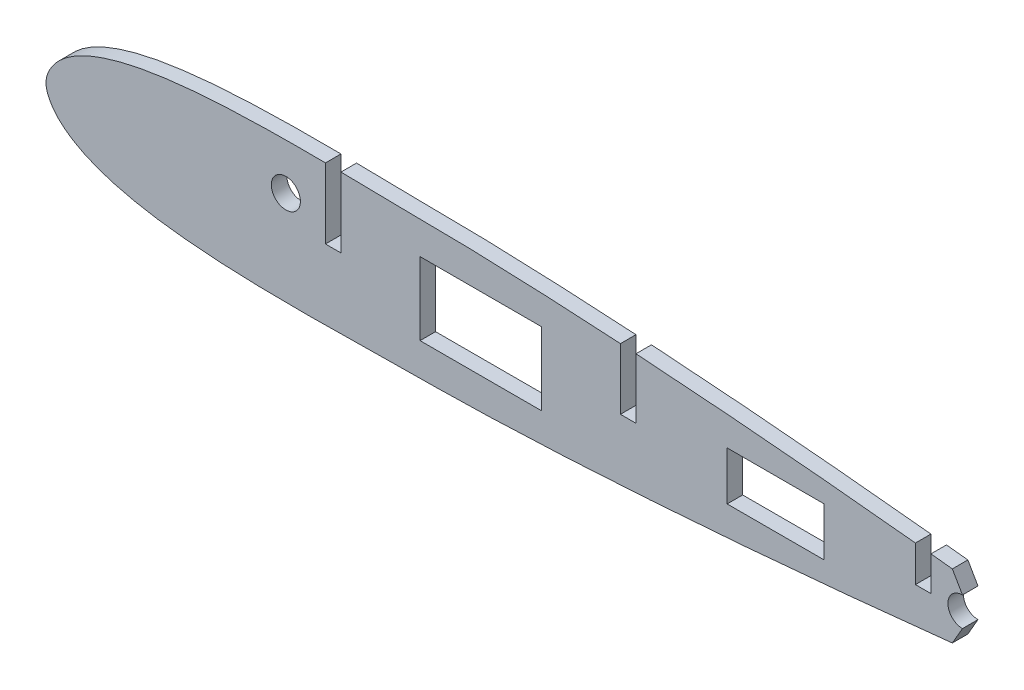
ISO-10303-21;
HEADER;
FILE_DESCRIPTION(('STEP AP214'),'2;1');
FILE_NAME('part.step','',(''),(''),'','','');
FILE_SCHEMA(('AUTOMOTIVE_DESIGN { 1 0 10303 214 1 1 1 1 }'));
ENDSEC;
DATA;
#1=APPLICATION_CONTEXT('core data for automotive mechanical design processes');
#2=APPLICATION_PROTOCOL_DEFINITION('international standard','automotive_design',2000,#1);
#3=PRODUCT_CONTEXT('',#1,'mechanical');
#4=PRODUCT('Part','Part','',(#3));
#5=PRODUCT_RELATED_PRODUCT_CATEGORY('part','',(#4));
#6=PRODUCT_DEFINITION_FORMATION('','',#4);
#7=PRODUCT_DEFINITION_CONTEXT('part definition',#1,'design');
#8=PRODUCT_DEFINITION('design','',#6,#7);
#9=PRODUCT_DEFINITION_SHAPE('','',#8);
#10=(LENGTH_UNIT() NAMED_UNIT(*) SI_UNIT(.MILLI.,.METRE.));
#11=(NAMED_UNIT(*) PLANE_ANGLE_UNIT() SI_UNIT($,.RADIAN.));
#12=(NAMED_UNIT(*) SI_UNIT($,.STERADIAN.) SOLID_ANGLE_UNIT());
#13=UNCERTAINTY_MEASURE_WITH_UNIT(LENGTH_MEASURE(1.E-05),#10,'distance_accuracy_value','');
#14=(GEOMETRIC_REPRESENTATION_CONTEXT(3) GLOBAL_UNCERTAINTY_ASSIGNED_CONTEXT((#13)) GLOBAL_UNIT_ASSIGNED_CONTEXT((#10,
#11,#12)) REPRESENTATION_CONTEXT('',''));
#15=CARTESIAN_POINT('',(0.,0.,0.));
#16=DIRECTION('',(0.,0.,1.));
#17=DIRECTION('',(1.,0.,0.));
#18=AXIS2_PLACEMENT_3D('',#15,#16,#17);
#19=CARTESIAN_POINT('',(73.1109777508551,2.76717396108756,3.2));
#20=DIRECTION('',(0.,0.,1.));
#21=DIRECTION('',(1.,0.,0.));
#22=AXIS2_PLACEMENT_3D('',#19,#20,#21);
#23=PLANE('',#22);
#24=CARTESIAN_POINT('',(-88.6046583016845,3.96718901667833,3.2));
#25=DIRECTION('',(0.,0.,1.));
#26=DIRECTION('',(1.,0.,0.));
#27=AXIS2_PLACEMENT_3D('',#24,#25,#26);
#28=CIRCLE('',#27,3.00000000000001);
#29=CARTESIAN_POINT('',(-85.6046583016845,3.96718901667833,3.2));
#30=VERTEX_POINT('',#29);
#31=EDGE_CURVE('E492',#30,#30,#28,.T.);
#32=ORIENTED_EDGE('',*,*,#31,.F.);
#33=EDGE_LOOP('',(#32));
#34=FACE_BOUND('',#33,.T.);
#35=DIRECTION('',(1.,0.,0.));
#36=VECTOR('',#35,1.);
#37=CARTESIAN_POINT('',(-60.9374477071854,-8.53281098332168,3.2));
#38=LINE('',#37,#36);
#39=CARTESIAN_POINT('',(-60.9374477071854,-8.53281098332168,3.2));
#40=VERTEX_POINT('',#39);
#41=CARTESIAN_POINT('',(-35.9374477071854,-8.53281098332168,3.2));
#42=VERTEX_POINT('',#41);
#43=EDGE_CURVE('E546',#40,#42,#38,.T.);
#44=ORIENTED_EDGE('',*,*,#43,.F.);
#45=DIRECTION('',(0.,-1.,0.));
#46=VECTOR('',#45,1.);
#47=CARTESIAN_POINT('',(-60.9374477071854,6.46718901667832,3.2));
#48=LINE('',#47,#46);
#49=CARTESIAN_POINT('',(-60.9374477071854,6.46718901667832,3.2));
#50=VERTEX_POINT('',#49);
#51=EDGE_CURVE('E543',#50,#40,#48,.T.);
#52=ORIENTED_EDGE('',*,*,#51,.F.);
#53=DIRECTION('',(-1.,0.,0.));
#54=VECTOR('',#53,1.);
#55=CARTESIAN_POINT('',(-60.9374477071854,6.46718901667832,3.2));
#56=LINE('',#55,#54);
#57=CARTESIAN_POINT('',(-35.9374477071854,6.46718901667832,3.2));
#58=VERTEX_POINT('',#57);
#59=EDGE_CURVE('E554',#58,#50,#56,.T.);
#60=ORIENTED_EDGE('',*,*,#59,.F.);
#61=DIRECTION('',(0.,1.,0.));
#62=VECTOR('',#61,1.);
#63=CARTESIAN_POINT('',(-35.9374477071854,6.46718901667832,3.2));
#64=LINE('',#63,#62);
#65=EDGE_CURVE('E550',#42,#58,#64,.T.);
#66=ORIENTED_EDGE('',*,*,#65,.F.);
#67=EDGE_LOOP('',(#44,#52,#60,#66));
#68=FACE_BOUND('',#67,.T.);
#69=DIRECTION('',(1.,0.,0.));
#70=VECTOR('',#69,1.);
#71=CARTESIAN_POINT('',(2.36255229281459,-6.03281098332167,3.2));
#72=LINE('',#71,#70);
#73=CARTESIAN_POINT('',(2.36255229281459,-6.03281098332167,3.2));
#74=VERTEX_POINT('',#73);
#75=CARTESIAN_POINT('',(22.3625522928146,-6.03281098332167,3.2));
#76=VERTEX_POINT('',#75);
#77=EDGE_CURVE('E503',#74,#76,#72,.T.);
#78=ORIENTED_EDGE('',*,*,#77,.F.);
#79=DIRECTION('',(0.,-1.,0.));
#80=VECTOR('',#79,1.);
#81=CARTESIAN_POINT('',(2.36255229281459,-6.03281098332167,3.2));
#82=LINE('',#81,#80);
#83=CARTESIAN_POINT('',(2.36255229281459,3.96718901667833,3.2));
#84=VERTEX_POINT('',#83);
#85=EDGE_CURVE('E500',#84,#74,#82,.T.);
#86=ORIENTED_EDGE('',*,*,#85,.F.);
#87=DIRECTION('',(-1.,0.,0.));
#88=VECTOR('',#87,1.);
#89=CARTESIAN_POINT('',(2.36255229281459,3.96718901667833,3.2));
#90=LINE('',#89,#88);
#91=CARTESIAN_POINT('',(22.3625522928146,3.96718901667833,3.2));
#92=VERTEX_POINT('',#91);
#93=EDGE_CURVE('E511',#92,#84,#90,.T.);
#94=ORIENTED_EDGE('',*,*,#93,.F.);
#95=DIRECTION('',(0.,1.,0.));
#96=VECTOR('',#95,1.);
#97=CARTESIAN_POINT('',(22.3625522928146,-6.03281098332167,3.2));
#98=LINE('',#97,#96);
#99=EDGE_CURVE('E507',#76,#92,#98,.T.);
#100=ORIENTED_EDGE('',*,*,#99,.F.);
#101=EDGE_LOOP('',(#78,#86,#94,#100));
#102=FACE_BOUND('',#101,.T.);
#103=CARTESIAN_POINT('',(50.8625522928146,-1.03281098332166,3.2));
#104=DIRECTION('',(0.,0.,1.));
#105=DIRECTION('',(1.,0.,0.));
#106=AXIS2_PLACEMENT_3D('',#103,#104,#105);
#107=CIRCLE('',#106,3.);
#108=CARTESIAN_POINT('',(50.8625522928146,-4.03281098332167,3.2));
#109=VERTEX_POINT('',#108);
#110=CARTESIAN_POINT('',(50.8625522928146,1.96718901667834,3.2));
#111=VERTEX_POINT('',#110);
#112=EDGE_CURVE('E483',#109,#111,#107,.F.);
#113=ORIENTED_EDGE('',*,*,#112,.T.);
#114=DIRECTION('',(-0.500000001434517,0.86602540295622,0.));
#115=VECTOR('',#114,1.);
#116=CARTESIAN_POINT('',(56.0782550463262,-7.06667311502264,3.2));
#117=LINE('',#116,#115);
#118=CARTESIAN_POINT('',(48.7762275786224,5.58080940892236,3.2));
#119=VERTEX_POINT('',#118);
#120=EDGE_CURVE('E476',#111,#119,#117,.T.);
#121=ORIENTED_EDGE('',*,*,#120,.T.);
#122=CARTESIAN_POINT('',(44.3625522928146,6.05528791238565,3.2));
#123=CARTESIAN_POINT('',(45.8339647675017,5.89887388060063,3.2));
#124=CARTESIAN_POINT('',(47.3051899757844,5.74069659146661,3.2));
#125=CARTESIAN_POINT('',(48.7762257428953,5.58077271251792,3.2));
#126=B_SPLINE_CURVE_WITH_KNOTS('',3,(#122,#123,#124,#125),.UNSPECIFIED.,.F.,.F.,(4,4),
(0.105515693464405,0.114627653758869),.UNSPECIFIED.);
#127=CARTESIAN_POINT('',(44.3625522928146,6.05528791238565,3.2));
#128=VERTEX_POINT('',#127);
#129=EDGE_CURVE('E278',#119,#128,#126,.F.);
#130=ORIENTED_EDGE('',*,*,#129,.T.);
#131=DIRECTION('',(0.,-1.,0.));
#132=VECTOR('',#131,1.);
#133=CARTESIAN_POINT('',(44.3625522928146,-1.03281098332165,3.2));
#134=LINE('',#133,#132);
#135=CARTESIAN_POINT('',(44.3625522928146,-1.03281098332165,3.2));
#136=VERTEX_POINT('',#135);
#137=EDGE_CURVE('E468',#128,#136,#134,.T.);
#138=ORIENTED_EDGE('',*,*,#137,.T.);
#139=DIRECTION('',(-1.,0.,0.));
#140=VECTOR('',#139,1.);
#141=CARTESIAN_POINT('',(41.1625522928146,-1.03281098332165,3.2));
#142=LINE('',#141,#140);
#143=CARTESIAN_POINT('',(41.1625522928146,-1.03281098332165,3.2));
#144=VERTEX_POINT('',#143);
#145=EDGE_CURVE('E418',#136,#144,#142,.T.);
#146=ORIENTED_EDGE('',*,*,#145,.T.);
#147=DIRECTION('',(0.,1.,0.));
#148=VECTOR('',#147,1.);
#149=CARTESIAN_POINT('',(41.1625522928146,-1.03281098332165,3.2));
#150=LINE('',#149,#148);
#151=CARTESIAN_POINT('',(41.1625522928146,6.39263718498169,3.2));
#152=VERTEX_POINT('',#151);
#153=EDGE_CURVE('E435',#144,#152,#150,.T.);
#154=ORIENTED_EDGE('',*,*,#153,.T.);
#155=CARTESIAN_POINT('',(41.1625522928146,6.39263718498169,3.2));
#156=CARTESIAN_POINT('',(40.8858120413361,6.42156748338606,3.2));
#157=CARTESIAN_POINT('',(36.6466893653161,6.86375130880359,3.2));
#158=CARTESIAN_POINT('',(28.444890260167,7.69043450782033,3.2));
#159=CARTESIAN_POINT('',(16.5536717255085,8.8075333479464,3.2));
#160=CARTESIAN_POINT('',(4.66201903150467,9.82931238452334,3.2));
#161=CARTESIAN_POINT('',(-6.33430215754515,10.6875926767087,3.2));
#162=CARTESIAN_POINT('',(-13.3686011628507,11.1761671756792,3.2));
#163=CARTESIAN_POINT('',(-16.4374477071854,11.3777301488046,3.2));
#164=B_SPLINE_CURVE_WITH_KNOTS('',3,(#155,#156,#157,#158,#159,#160,#161,#162,#163),
.UNSPECIFIED.,.F.,.F.,(4,1,1,1,1,1,4),(0.121232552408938,0.12294599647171,0.147478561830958,
0.171994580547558,0.196493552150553,0.220976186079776,0.239914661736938),.UNSPECIFIED.);
#165=CARTESIAN_POINT('',(-16.4374477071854,11.3777301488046,3.2));
#166=VERTEX_POINT('',#165);
#167=EDGE_CURVE('E431',#152,#166,#164,.T.);
#168=ORIENTED_EDGE('',*,*,#167,.T.);
#169=DIRECTION('',(0.,-1.,0.));
#170=VECTOR('',#169,1.);
#171=CARTESIAN_POINT('',(-16.4374477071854,-1.03281098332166,3.2));
#172=LINE('',#171,#170);
#173=CARTESIAN_POINT('',(-16.4374477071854,-1.03281098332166,3.2));
#174=VERTEX_POINT('',#173);
#175=EDGE_CURVE('E434',#166,#174,#172,.T.);
#176=ORIENTED_EDGE('',*,*,#175,.T.);
#177=DIRECTION('',(-1.,0.,0.));
#178=VECTOR('',#177,1.);
#179=CARTESIAN_POINT('',(-19.6374477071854,-1.03281098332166,3.2));
#180=LINE('',#179,#178);
#181=CARTESIAN_POINT('',(-19.6374477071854,-1.03281098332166,3.2));
#182=VERTEX_POINT('',#181);
#183=EDGE_CURVE('E440',#174,#182,#180,.T.);
#184=ORIENTED_EDGE('',*,*,#183,.T.);
#185=DIRECTION('',(0.,1.,0.));
#186=VECTOR('',#185,1.);
#187=CARTESIAN_POINT('',(-19.6374477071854,-1.03281098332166,3.2));
#188=LINE('',#187,#186);
#189=CARTESIAN_POINT('',(-19.6374477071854,11.5837049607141,3.2));
#190=VERTEX_POINT('',#189);
#191=EDGE_CURVE('E914',#182,#190,#188,.T.);
#192=ORIENTED_EDGE('',*,*,#191,.T.);
#193=CARTESIAN_POINT('',(-19.6374477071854,11.5837049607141,3.2));
#194=CARTESIAN_POINT('',(-23.5083202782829,11.827758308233,3.2));
#195=CARTESIAN_POINT('',(-31.3414661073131,12.2834181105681,3.2));
#196=CARTESIAN_POINT('',(-43.1420287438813,12.7942893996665,3.2));
#197=CARTESIAN_POINT('',(-55.0341757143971,13.1770742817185,3.2));
#198=CARTESIAN_POINT('',(-64.8677051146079,13.1698438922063,3.2));
#199=CARTESIAN_POINT('',(-72.2668637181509,13.3417556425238,3.2));
#200=CARTESIAN_POINT('',(-75.703508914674,13.3931359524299,3.2));
#201=CARTESIAN_POINT('',(-77.2374477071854,13.4117089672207,3.2));
#202=B_SPLINE_CURVE_WITH_KNOTS('',3,(#193,#194,#195,#196,#197,#198,#199,#200,#201),
.UNSPECIFIED.,.F.,.F.,(4,1,1,1,1,1,4),(0.246496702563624,0.270380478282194,0.29481296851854,
0.319231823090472,0.343641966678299,0.355360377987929,0.364806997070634),.UNSPECIFIED.);
#203=CARTESIAN_POINT('',(-77.2374477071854,13.4117089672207,3.2));
#204=VERTEX_POINT('',#203);
#205=EDGE_CURVE('E910',#190,#204,#202,.T.);
#206=ORIENTED_EDGE('',*,*,#205,.T.);
#207=DIRECTION('',(0.,-1.,0.));
#208=VECTOR('',#207,1.);
#209=CARTESIAN_POINT('',(-77.2374477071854,-1.03281098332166,3.2));
#210=LINE('',#209,#208);
#211=CARTESIAN_POINT('',(-77.2374477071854,-1.03281098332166,3.2));
#212=VERTEX_POINT('',#211);
#213=EDGE_CURVE('E913',#204,#212,#210,.T.);
#214=ORIENTED_EDGE('',*,*,#213,.T.);
#215=DIRECTION('',(-1.,0.,0.));
#216=VECTOR('',#215,1.);
#217=CARTESIAN_POINT('',(-80.4374477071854,-1.03281098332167,3.2));
#218=LINE('',#217,#216);
#219=CARTESIAN_POINT('',(-80.4374477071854,-1.03281098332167,3.2));
#220=VERTEX_POINT('',#219);
#221=EDGE_CURVE('E316',#212,#220,#218,.T.);
#222=ORIENTED_EDGE('',*,*,#221,.T.);
#223=DIRECTION('',(0.,1.,0.));
#224=VECTOR('',#223,1.);
#225=CARTESIAN_POINT('',(-80.4374477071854,-1.03281098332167,3.2));
#226=LINE('',#225,#224);
#227=CARTESIAN_POINT('',(-80.4374477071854,13.4443350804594,3.2));
#228=VERTEX_POINT('',#227);
#229=EDGE_CURVE('E236',#220,#228,#226,.T.);
#230=ORIENTED_EDGE('',*,*,#229,.T.);
#231=CARTESIAN_POINT('',(48.7726808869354,-7.65250874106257,3.2));
#232=CARTESIAN_POINT('',(45.9601822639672,-7.95856970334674,3.2));
#233=CARTESIAN_POINT('',(39.1855199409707,-8.68024311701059,3.2));
#234=CARTESIAN_POINT('',(28.4458294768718,-9.76389533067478,3.2));
#235=CARTESIAN_POINT('',(16.5547312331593,-10.8822738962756,3.2));
#236=CARTESIAN_POINT('',(4.66318857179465,-11.9053327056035,3.2));
#237=CARTESIAN_POINT('',(-7.22792859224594,-12.8347407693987,3.2));
#238=CARTESIAN_POINT('',(-19.1986067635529,-13.6543817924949,3.2));
#239=CARTESIAN_POINT('',(-31.1689328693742,-14.3558874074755,3.2));
#240=CARTESIAN_POINT('',(-43.1405398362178,-14.8754543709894,3.2));
#241=CARTESIAN_POINT('',(-55.0326455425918,-15.2595190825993,3.2));
#242=CARTESIAN_POINT('',(-64.8661756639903,-15.2533469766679,3.2));
#243=CARTESIAN_POINT('',(-72.7132535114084,-15.4365106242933,3.2));
#244=CARTESIAN_POINT('',(-78.5797220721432,-15.518516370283,3.2));
#245=CARTESIAN_POINT('',(-84.5255792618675,-15.5617901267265,3.2));
#246=CARTESIAN_POINT('',(-90.4719237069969,-15.5358258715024,3.2));
#247=CARTESIAN_POINT('',(-96.4190160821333,-15.4127594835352,3.2));
#248=CARTESIAN_POINT('',(-102.36777540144,-15.161949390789,3.2));
#249=CARTESIAN_POINT('',(-108.319189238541,-14.7332647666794,3.2));
#250=CARTESIAN_POINT('',(-113.876633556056,-14.1149004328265,3.2));
#251=CARTESIAN_POINT('',(-119.039849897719,-13.2685763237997,3.2));
#252=CARTESIAN_POINT('',(-123.006900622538,-12.366000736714,3.2));
#253=CARTESIAN_POINT('',(-126.168593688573,-11.4102824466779,3.2));
#254=CARTESIAN_POINT('',(-128.56161871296,-10.5358069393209,3.2));
#255=CARTESIAN_POINT('',(-130.968718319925,-9.43922639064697,3.2));
#256=CARTESIAN_POINT('',(-133.41846393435,-8.00234949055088,3.2));
#257=CARTESIAN_POINT('',(-135.450617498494,-6.3218790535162,3.2));
#258=CARTESIAN_POINT('',(-137.240403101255,-4.07244498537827,3.2));
#259=CARTESIAN_POINT('',(-138.557845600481,-1.04571684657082,3.2));
#260=CARTESIAN_POINT('',(-137.240728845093,1.98115305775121,3.2));
#261=CARTESIAN_POINT('',(-135.451185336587,4.23077972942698,3.2));
#262=CARTESIAN_POINT('',(-133.419212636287,5.91146885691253,3.2));
#263=CARTESIAN_POINT('',(-130.96962167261,7.3486093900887,3.2));
#264=CARTESIAN_POINT('',(-128.562640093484,8.44544898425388,3.2));
#265=CARTESIAN_POINT('',(-126.169709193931,9.32018202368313,3.2));
#266=CARTESIAN_POINT('',(-123.008119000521,10.276240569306,3.2));
#267=CARTESIAN_POINT('',(-119.041165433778,11.1792430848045,3.2));
#268=CARTESIAN_POINT('',(-113.878040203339,12.026122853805,3.2));
#269=CARTESIAN_POINT('',(-108.320662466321,12.6450852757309,3.2));
#270=CARTESIAN_POINT('',(-102.369294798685,13.0744103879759,3.2));
#271=CARTESIAN_POINT('',(-96.4205625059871,13.3258606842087,3.2));
#272=CARTESIAN_POINT('',(-90.4734834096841,13.4495670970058,3.2));
#273=CARTESIAN_POINT('',(-85.1458243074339,13.4734032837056,3.2));
#274=CARTESIAN_POINT('',(-81.8006706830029,13.4554971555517,3.2));
#275=CARTESIAN_POINT('',(-80.4374477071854,13.4443350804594,3.2));
#276=B_SPLINE_CURVE_WITH_KNOTS('',3,(#231,#232,#233,#234,#235,#236,#237,#238,#239,#240,#241,
#242,#243,#244,#245,#246,#247,#248,#249,#250,#251,#252,#253,#254,#255,#256,#257,#258,#259,#260,
#261,#262,#263,#264,#265,#266,#267,#268,#269,#270,#271,#272,#273,#274,#275),.UNSPECIFIED.,.F.,
.F.,(4,1,1,1,1,1,1,1,1,1,1,1,1,1,1,1,1,1,1,1,1,1,1,1,1,1,1,1,1,1,1,1,1,1,1,1,1,1,1,1,1,1,4),
(0.371375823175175,0.388797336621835,0.413329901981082,0.437845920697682,0.462344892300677,
0.486827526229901,0.511293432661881,0.536231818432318,0.560664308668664,0.585083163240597,
0.609493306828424,0.621211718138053,0.633417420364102,0.645622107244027,0.657826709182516,
0.670033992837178,0.682250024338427,0.694487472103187,0.706771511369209,0.716669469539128,
0.726694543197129,0.731796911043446,0.737000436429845,0.742373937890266,0.748059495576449,
0.754469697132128,0.758419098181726,0.765851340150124,0.773283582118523,0.777232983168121,
0.7836431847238,0.789328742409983,0.794702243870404,0.799905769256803,0.80500813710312,
0.815033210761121,0.82493116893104,0.837215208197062,0.849452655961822,0.861668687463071,
0.873875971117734,0.886080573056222,0.89447551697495),.UNSPECIFIED.);
#277=CARTESIAN_POINT('',(48.7727036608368,-7.65253499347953,3.2017127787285));
#278=VERTEX_POINT('',#277);
#279=EDGE_CURVE('E226',#228,#278,#276,.F.);
#280=ORIENTED_EDGE('',*,*,#279,.T.);
#281=DIRECTION('',(-0.499999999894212,-0.866025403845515,0.));
#282=VECTOR('',#281,1.);
#283=CARTESIAN_POINT('',(59.3691385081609,10.7010285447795,3.2));
#284=LINE('',#283,#282);
#285=EDGE_CURVE('E210',#109,#278,#284,.T.);
#286=ORIENTED_EDGE('',*,*,#285,.F.);
#287=EDGE_LOOP('',(#113,#121,#130,#138,#146,#154,#168,#176,#184,#192,#206,#214,#222,#230,#280,#286));
#288=FACE_BOUND('',#287,.T.);
#289=ADVANCED_FACE('F49',(#34,#68,#102,#288),#23,.T.);
#290=CARTESIAN_POINT('',(73.1109777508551,2.76717396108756,0.));
#291=DIRECTION('',(0.,0.,1.));
#292=DIRECTION('',(1.,0.,0.));
#293=AXIS2_PLACEMENT_3D('',#290,#291,#292);
#294=PLANE('',#293);
#295=CARTESIAN_POINT('',(-88.6046583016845,3.96718901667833,0.));
#296=DIRECTION('',(0.,0.,1.));
#297=DIRECTION('',(1.,0.,0.));
#298=AXIS2_PLACEMENT_3D('',#295,#296,#297);
#299=CIRCLE('',#298,3.00000000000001);
#300=CARTESIAN_POINT('',(-85.6046583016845,3.96718901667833,0.));
#301=VERTEX_POINT('',#300);
#302=EDGE_CURVE('E488',#301,#301,#299,.T.);
#303=ORIENTED_EDGE('',*,*,#302,.T.);
#304=EDGE_LOOP('',(#303));
#305=FACE_BOUND('',#304,.T.);
#306=DIRECTION('',(0.,-1.,0.));
#307=VECTOR('',#306,1.);
#308=CARTESIAN_POINT('',(2.36255229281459,-6.03281098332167,0.));
#309=LINE('',#308,#307);
#310=CARTESIAN_POINT('',(2.3625522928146,3.96718901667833,0.));
#311=VERTEX_POINT('',#310);
#312=CARTESIAN_POINT('',(2.36255229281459,-6.03281098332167,0.));
#313=VERTEX_POINT('',#312);
#314=EDGE_CURVE('E496',#311,#313,#309,.T.);
#315=ORIENTED_EDGE('',*,*,#314,.T.);
#316=DIRECTION('',(1.,0.,0.));
#317=VECTOR('',#316,1.);
#318=CARTESIAN_POINT('',(2.36255229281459,-6.03281098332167,0.));
#319=LINE('',#318,#317);
#320=CARTESIAN_POINT('',(22.3625522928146,-6.03281098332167,0.));
#321=VERTEX_POINT('',#320);
#322=EDGE_CURVE('E518',#313,#321,#319,.T.);
#323=ORIENTED_EDGE('',*,*,#322,.T.);
#324=DIRECTION('',(0.,1.,0.));
#325=VECTOR('',#324,1.);
#326=CARTESIAN_POINT('',(22.3625522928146,-6.03281098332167,0.));
#327=LINE('',#326,#325);
#328=CARTESIAN_POINT('',(22.3625522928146,3.96718901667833,0.));
#329=VERTEX_POINT('',#328);
#330=EDGE_CURVE('E522',#321,#329,#327,.T.);
#331=ORIENTED_EDGE('',*,*,#330,.T.);
#332=DIRECTION('',(-1.,0.,0.));
#333=VECTOR('',#332,1.);
#334=CARTESIAN_POINT('',(2.36255229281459,3.96718901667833,0.));
#335=LINE('',#334,#333);
#336=EDGE_CURVE('E504',#329,#311,#335,.T.);
#337=ORIENTED_EDGE('',*,*,#336,.T.);
#338=EDGE_LOOP('',(#315,#323,#331,#337));
#339=FACE_BOUND('',#338,.T.);
#340=DIRECTION('',(0.,-1.,0.));
#341=VECTOR('',#340,1.);
#342=CARTESIAN_POINT('',(-60.9374477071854,6.46718901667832,0.));
#343=LINE('',#342,#341);
#344=CARTESIAN_POINT('',(-60.9374477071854,6.46718901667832,0.));
#345=VERTEX_POINT('',#344);
#346=CARTESIAN_POINT('',(-60.9374477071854,-8.53281098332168,0.));
#347=VERTEX_POINT('',#346);
#348=EDGE_CURVE('E542',#345,#347,#343,.T.);
#349=ORIENTED_EDGE('',*,*,#348,.T.);
#350=DIRECTION('',(1.,0.,0.));
#351=VECTOR('',#350,1.);
#352=CARTESIAN_POINT('',(-60.9374477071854,-8.53281098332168,0.));
#353=LINE('',#352,#351);
#354=CARTESIAN_POINT('',(-35.9374477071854,-8.53281098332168,0.));
#355=VERTEX_POINT('',#354);
#356=EDGE_CURVE('E561',#347,#355,#353,.T.);
#357=ORIENTED_EDGE('',*,*,#356,.T.);
#358=DIRECTION('',(0.,1.,0.));
#359=VECTOR('',#358,1.);
#360=CARTESIAN_POINT('',(-35.9374477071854,6.46718901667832,0.));
#361=LINE('',#360,#359);
#362=CARTESIAN_POINT('',(-35.9374477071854,6.46718901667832,0.));
#363=VERTEX_POINT('',#362);
#364=EDGE_CURVE('E565',#355,#363,#361,.T.);
#365=ORIENTED_EDGE('',*,*,#364,.T.);
#366=DIRECTION('',(-1.,0.,0.));
#367=VECTOR('',#366,1.);
#368=CARTESIAN_POINT('',(-60.9374477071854,6.46718901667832,0.));
#369=LINE('',#368,#367);
#370=EDGE_CURVE('E547',#363,#345,#369,.T.);
#371=ORIENTED_EDGE('',*,*,#370,.T.);
#372=EDGE_LOOP('',(#349,#357,#365,#371));
#373=FACE_BOUND('',#372,.T.);
#374=DIRECTION('',(-0.500000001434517,0.86602540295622,0.));
#375=VECTOR('',#374,1.);
#376=CARTESIAN_POINT('',(56.0782550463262,-7.06667311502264,0.));
#377=LINE('',#376,#375);
#378=CARTESIAN_POINT('',(50.8625522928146,1.96718901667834,0.));
#379=VERTEX_POINT('',#378);
#380=CARTESIAN_POINT('',(48.7762503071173,5.5807700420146,0.));
#381=VERTEX_POINT('',#380);
#382=EDGE_CURVE('E471',#379,#381,#377,.T.);
#383=ORIENTED_EDGE('',*,*,#382,.F.);
#384=CARTESIAN_POINT('',(50.8625522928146,-1.03281098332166,0.));
#385=DIRECTION('',(0.,0.,-1.));
#386=DIRECTION('',(-1.,0.,0.));
#387=AXIS2_PLACEMENT_3D('',#384,#385,#386);
#388=CIRCLE('',#387,3.);
#389=CARTESIAN_POINT('',(50.8625522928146,-4.03281098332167,0.));
#390=VERTEX_POINT('',#389);
#391=EDGE_CURVE('E473',#390,#379,#388,.T.);
#392=ORIENTED_EDGE('',*,*,#391,.F.);
#393=DIRECTION('',(-0.499999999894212,-0.866025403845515,0.));
#394=VECTOR('',#393,1.);
#395=CARTESIAN_POINT('',(59.3691385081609,10.7010285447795,0.));
#396=LINE('',#395,#394);
#397=CARTESIAN_POINT('',(48.7727214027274,-7.65250477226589,-1.20769492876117E-05));
#398=VERTEX_POINT('',#397);
#399=EDGE_CURVE('E70',#390,#398,#396,.T.);
#400=ORIENTED_EDGE('',*,*,#399,.T.);
#401=CARTESIAN_POINT('',(-80.4374477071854,13.4443350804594,0.));
#402=CARTESIAN_POINT('',(-81.8006706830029,13.4554971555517,0.));
#403=CARTESIAN_POINT('',(-85.1458243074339,13.4734032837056,0.));
#404=CARTESIAN_POINT('',(-90.4734834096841,13.4495670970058,0.));
#405=CARTESIAN_POINT('',(-96.4205625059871,13.3258606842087,0.));
#406=CARTESIAN_POINT('',(-102.369294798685,13.0744103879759,0.));
#407=CARTESIAN_POINT('',(-108.320662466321,12.6450852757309,0.));
#408=CARTESIAN_POINT('',(-113.878040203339,12.026122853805,0.));
#409=CARTESIAN_POINT('',(-119.041165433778,11.1792430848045,0.));
#410=CARTESIAN_POINT('',(-123.008119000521,10.276240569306,0.));
#411=CARTESIAN_POINT('',(-126.169709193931,9.32018202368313,0.));
#412=CARTESIAN_POINT('',(-128.562640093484,8.44544898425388,0.));
#413=CARTESIAN_POINT('',(-130.96962167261,7.3486093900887,0.));
#414=CARTESIAN_POINT('',(-133.419212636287,5.91146885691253,0.));
#415=CARTESIAN_POINT('',(-135.451185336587,4.23077972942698,0.));
#416=CARTESIAN_POINT('',(-137.240728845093,1.98115305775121,0.));
#417=CARTESIAN_POINT('',(-138.557845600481,-1.04571684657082,0.));
#418=CARTESIAN_POINT('',(-137.240403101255,-4.07244498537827,0.));
#419=CARTESIAN_POINT('',(-135.450617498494,-6.3218790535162,0.));
#420=CARTESIAN_POINT('',(-133.41846393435,-8.00234949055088,0.));
#421=CARTESIAN_POINT('',(-130.968718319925,-9.43922639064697,0.));
#422=CARTESIAN_POINT('',(-128.56161871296,-10.5358069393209,0.));
#423=CARTESIAN_POINT('',(-126.168593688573,-11.4102824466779,0.));
#424=CARTESIAN_POINT('',(-123.006900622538,-12.366000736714,0.));
#425=CARTESIAN_POINT('',(-119.039849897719,-13.2685763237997,0.));
#426=CARTESIAN_POINT('',(-113.876633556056,-14.1149004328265,0.));
#427=CARTESIAN_POINT('',(-108.319189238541,-14.7332647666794,0.));
#428=CARTESIAN_POINT('',(-102.36777540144,-15.161949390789,0.));
#429=CARTESIAN_POINT('',(-96.4190160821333,-15.4127594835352,0.));
#430=CARTESIAN_POINT('',(-90.4719237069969,-15.5358258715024,0.));
#431=CARTESIAN_POINT('',(-84.5255792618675,-15.5617901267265,0.));
#432=CARTESIAN_POINT('',(-78.5797220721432,-15.518516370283,0.));
#433=CARTESIAN_POINT('',(-72.7132535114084,-15.4365106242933,0.));
#434=CARTESIAN_POINT('',(-64.8661756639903,-15.2533469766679,0.));
#435=CARTESIAN_POINT('',(-55.0326455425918,-15.2595190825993,0.));
#436=CARTESIAN_POINT('',(-43.1405398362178,-14.8754543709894,0.));
#437=CARTESIAN_POINT('',(-31.1689328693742,-14.3558874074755,0.));
#438=CARTESIAN_POINT('',(-19.1986067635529,-13.6543817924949,0.));
#439=CARTESIAN_POINT('',(-7.22792859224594,-12.8347407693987,0.));
#440=CARTESIAN_POINT('',(4.66318857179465,-11.9053327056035,0.));
#441=CARTESIAN_POINT('',(16.5547312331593,-10.8822738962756,0.));
#442=CARTESIAN_POINT('',(28.4458294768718,-9.76389533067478,0.));
#443=CARTESIAN_POINT('',(39.1855334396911,-8.68024175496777,0.));
#444=CARTESIAN_POINT('',(45.9602092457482,-7.95856682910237,0.));
#445=CARTESIAN_POINT('',(48.7727213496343,-7.65250433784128,0.));
#446=B_SPLINE_CURVE_WITH_KNOTS('',3,(#401,#402,#403,#404,#405,#406,#407,#408,#409,#410,#411,
#412,#413,#414,#415,#416,#417,#418,#419,#420,#421,#422,#423,#424,#425,#426,#427,#428,#429,#430,
#431,#432,#433,#434,#435,#436,#437,#438,#439,#440,#441,#442,#443,#444,#445),.UNSPECIFIED.,.F.,
.F.,(4,1,1,1,1,1,1,1,1,1,1,1,1,1,1,1,1,1,1,1,1,1,1,1,1,1,1,1,1,1,1,1,1,1,1,1,1,1,1,1,1,1,4),
(0.371375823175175,0.379770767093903,0.391975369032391,0.404182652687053,0.416398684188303,
0.428636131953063,0.440920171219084,0.450818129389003,0.460843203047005,0.465945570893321,
0.471149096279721,0.476522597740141,0.482208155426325,0.488618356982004,0.492567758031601,0.5,
0.507432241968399,0.511381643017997,0.517791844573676,0.523477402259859,0.528850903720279,
0.534054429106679,0.539156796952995,0.549181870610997,0.559079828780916,0.571363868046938,
0.583601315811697,0.595817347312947,0.608024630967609,0.620229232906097,0.632433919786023,
0.644639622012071,0.656358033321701,0.680768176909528,0.70518703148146,0.729619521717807,
0.754557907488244,0.779023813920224,0.803506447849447,0.828005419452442,0.852521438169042,
0.87705400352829,0.894475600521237),.UNSPECIFIED.);
#447=CARTESIAN_POINT('',(-80.4374477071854,13.4443350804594,0.));
#448=VERTEX_POINT('',#447);
#449=EDGE_CURVE('E229',#448,#398,#446,.T.);
#450=ORIENTED_EDGE('',*,*,#449,.F.);
#451=DIRECTION('',(-8.50716584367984E-13,1.,0.));
#452=VECTOR('',#451,1.);
#453=CARTESIAN_POINT('',(-80.4374477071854,13.4117089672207,0.));
#454=LINE('',#453,#452);
#455=CARTESIAN_POINT('',(-80.4374477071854,-1.03281098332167,0.));
#456=VERTEX_POINT('',#455);
#457=EDGE_CURVE('E282',#456,#448,#454,.T.);
#458=ORIENTED_EDGE('',*,*,#457,.F.);
#459=DIRECTION('',(-1.,0.,0.));
#460=VECTOR('',#459,1.);
#461=CARTESIAN_POINT('',(-80.4374477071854,-1.03281098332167,0.));
#462=LINE('',#461,#460);
#463=CARTESIAN_POINT('',(-77.2374477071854,-1.03281098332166,0.));
#464=VERTEX_POINT('',#463);
#465=EDGE_CURVE('E285',#464,#456,#462,.T.);
#466=ORIENTED_EDGE('',*,*,#465,.F.);
#467=DIRECTION('',(0.,-1.,0.));
#468=VECTOR('',#467,1.);
#469=CARTESIAN_POINT('',(-77.2374477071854,-1.03281098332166,0.));
#470=LINE('',#469,#468);
#471=CARTESIAN_POINT('',(-77.2374477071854,13.4117089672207,0.));
#472=VERTEX_POINT('',#471);
#473=EDGE_CURVE('E363',#472,#464,#470,.T.);
#474=ORIENTED_EDGE('',*,*,#473,.F.);
#475=CARTESIAN_POINT('',(-19.6374477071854,11.5837049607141,0.));
#476=CARTESIAN_POINT('',(-23.5083202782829,11.827758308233,0.));
#477=CARTESIAN_POINT('',(-31.3414661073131,12.2834181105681,0.));
#478=CARTESIAN_POINT('',(-43.1420287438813,12.7942893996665,0.));
#479=CARTESIAN_POINT('',(-55.0341757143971,13.1770742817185,0.));
#480=CARTESIAN_POINT('',(-64.8677051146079,13.1698438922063,0.));
#481=CARTESIAN_POINT('',(-72.2668637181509,13.3417556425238,0.));
#482=CARTESIAN_POINT('',(-75.703508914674,13.3931359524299,0.));
#483=CARTESIAN_POINT('',(-77.2374477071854,13.4117089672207,0.));
#484=B_SPLINE_CURVE_WITH_KNOTS('',3,(#475,#476,#477,#478,#479,#480,#481,#482,#483),
.UNSPECIFIED.,.F.,.F.,(4,1,1,1,1,1,4),(0.246496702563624,0.270380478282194,0.29481296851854,
0.319231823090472,0.343641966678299,0.355360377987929,0.364806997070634),.UNSPECIFIED.);
#485=CARTESIAN_POINT('',(-19.6374477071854,11.5837049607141,0.));
#486=VERTEX_POINT('',#485);
#487=EDGE_CURVE('E358',#486,#472,#484,.T.);
#488=ORIENTED_EDGE('',*,*,#487,.F.);
#489=DIRECTION('',(0.,1.,0.));
#490=VECTOR('',#489,1.);
#491=CARTESIAN_POINT('',(-19.6374477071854,11.3777301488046,0.));
#492=LINE('',#491,#490);
#493=CARTESIAN_POINT('',(-19.6374477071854,-1.03281098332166,0.));
#494=VERTEX_POINT('',#493);
#495=EDGE_CURVE('E355',#494,#486,#492,.T.);
#496=ORIENTED_EDGE('',*,*,#495,.F.);
#497=DIRECTION('',(-1.,0.,0.));
#498=VECTOR('',#497,1.);
#499=CARTESIAN_POINT('',(-19.6374477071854,-1.03281098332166,0.));
#500=LINE('',#499,#498);
#501=CARTESIAN_POINT('',(-16.4374477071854,-1.03281098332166,0.));
#502=VERTEX_POINT('',#501);
#503=EDGE_CURVE('E351',#502,#494,#500,.T.);
#504=ORIENTED_EDGE('',*,*,#503,.F.);
#505=DIRECTION('',(0.,-1.,0.));
#506=VECTOR('',#505,1.);
#507=CARTESIAN_POINT('',(-16.4374477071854,-1.03281098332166,0.));
#508=LINE('',#507,#506);
#509=CARTESIAN_POINT('',(-16.4374477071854,11.3777301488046,0.));
#510=VERTEX_POINT('',#509);
#511=EDGE_CURVE('E345',#510,#502,#508,.T.);
#512=ORIENTED_EDGE('',*,*,#511,.F.);
#513=CARTESIAN_POINT('',(41.1625522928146,6.39263718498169,0.));
#514=CARTESIAN_POINT('',(40.8858120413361,6.42156748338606,0.));
#515=CARTESIAN_POINT('',(36.6466893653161,6.86375130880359,0.));
#516=CARTESIAN_POINT('',(28.444890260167,7.69043450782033,0.));
#517=CARTESIAN_POINT('',(16.5536717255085,8.8075333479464,0.));
#518=CARTESIAN_POINT('',(4.66201903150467,9.82931238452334,0.));
#519=CARTESIAN_POINT('',(-6.33430215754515,10.6875926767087,0.));
#520=CARTESIAN_POINT('',(-13.3686011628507,11.1761671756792,0.));
#521=CARTESIAN_POINT('',(-16.4374477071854,11.3777301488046,0.));
#522=B_SPLINE_CURVE_WITH_KNOTS('',3,(#513,#514,#515,#516,#517,#518,#519,#520,#521),
.UNSPECIFIED.,.F.,.F.,(4,1,1,1,1,1,4),(0.121232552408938,0.12294599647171,0.147478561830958,
0.171994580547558,0.196493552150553,0.220976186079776,0.239914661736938),.UNSPECIFIED.);
#523=CARTESIAN_POINT('',(41.1625522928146,6.39263718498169,0.));
#524=VERTEX_POINT('',#523);
#525=EDGE_CURVE('E340',#524,#510,#522,.T.);
#526=ORIENTED_EDGE('',*,*,#525,.F.);
#527=DIRECTION('',(0.,1.,0.));
#528=VECTOR('',#527,1.);
#529=CARTESIAN_POINT('',(41.1625522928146,6.05528791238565,0.));
#530=LINE('',#529,#528);
#531=CARTESIAN_POINT('',(41.1625522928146,-1.03281098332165,0.));
#532=VERTEX_POINT('',#531);
#533=EDGE_CURVE('E337',#532,#524,#530,.T.);
#534=ORIENTED_EDGE('',*,*,#533,.F.);
#535=DIRECTION('',(-1.,0.,0.));
#536=VECTOR('',#535,1.);
#537=CARTESIAN_POINT('',(41.1625522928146,-1.03281098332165,0.));
#538=LINE('',#537,#536);
#539=CARTESIAN_POINT('',(44.3625522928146,-1.03281098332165,0.));
#540=VERTEX_POINT('',#539);
#541=EDGE_CURVE('E333',#540,#532,#538,.T.);
#542=ORIENTED_EDGE('',*,*,#541,.F.);
#543=DIRECTION('',(0.,-1.,0.));
#544=VECTOR('',#543,1.);
#545=CARTESIAN_POINT('',(44.3625522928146,-1.03281098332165,0.));
#546=LINE('',#545,#544);
#547=CARTESIAN_POINT('',(44.3625522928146,6.05528791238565,0.));
#548=VERTEX_POINT('',#547);
#549=EDGE_CURVE('E326',#548,#540,#546,.T.);
#550=ORIENTED_EDGE('',*,*,#549,.F.);
#551=CARTESIAN_POINT('',(101.799188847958,-1.01023941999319,0.));
#552=CARTESIAN_POINT('',(97.1662744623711,-0.37213420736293,0.));
#553=CARTESIAN_POINT('',(88.5756524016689,0.81992622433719,0.));
#554=CARTESIAN_POINT('',(76.0115979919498,2.42157660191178,0.));
#555=CARTESIAN_POINT('',(64.120042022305,3.86166442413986,0.));
#556=CARTESIAN_POINT('',(53.5701477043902,5.06228088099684,0.));
#557=CARTESIAN_POINT('',(46.9835418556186,5.77667158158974,0.));
#558=CARTESIAN_POINT('',(44.3625522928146,6.05528791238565,0.));
#559=B_SPLINE_CURVE_WITH_KNOTS('',3,(#551,#552,#553,#554,#555,#556,#557,#558),.UNSPECIFIED.,.F.,
.F.,(4,1,1,1,1,4),(-0.00416433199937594,0.0246342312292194,0.0492428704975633,
0.0738297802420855,0.0983967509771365,0.114627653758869),.UNSPECIFIED.);
#560=EDGE_CURVE('E318',#381,#548,#559,.T.);
#561=ORIENTED_EDGE('',*,*,#560,.F.);
#562=EDGE_LOOP('',(#383,#392,#400,#450,#458,#466,#474,#488,#496,#504,#512,#526,#534,#542,#550,#561));
#563=FACE_BOUND('',#562,.T.);
#564=ADVANCED_FACE('F256',(#305,#339,#373,#563),#294,.F.);
#565=CARTESIAN_POINT('',(101.799188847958,-1.01023941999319,3.2));
#566=CARTESIAN_POINT('',(97.1662744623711,-0.37213420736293,3.2));
#567=CARTESIAN_POINT('',(88.5756524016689,0.81992622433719,3.2));
#568=CARTESIAN_POINT('',(76.0115979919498,2.42157660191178,3.2));
#569=CARTESIAN_POINT('',(64.120042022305,3.86166442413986,3.2));
#570=CARTESIAN_POINT('',(53.5701477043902,5.06228088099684,3.2));
#571=CARTESIAN_POINT('',(46.9835418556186,5.77667158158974,3.2));
#572=CARTESIAN_POINT('',(44.3625522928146,6.05528791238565,3.2));
#573=B_SPLINE_CURVE_WITH_KNOTS('',3,(#565,#566,#567,#568,#569,#570,#571,#572),.UNSPECIFIED.,.F.,
.F.,(4,1,1,1,1,4),(-0.00416433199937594,0.0246342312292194,0.0492428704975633,
0.0738297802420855,0.0983967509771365,0.114627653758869),.UNSPECIFIED.);
#574=DIRECTION('',(0.,0.,-1.));
#575=VECTOR('',#574,1.);
#576=SURFACE_OF_LINEAR_EXTRUSION('',#573,#575);
#577=DIRECTION('',(0.,0.,-1.));
#578=VECTOR('',#577,1.);
#579=CARTESIAN_POINT('',(48.7762503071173,5.5807700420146,3.2));
#580=LINE('',#579,#578);
#581=EDGE_CURVE('E232',#381,#119,#580,.F.);
#582=ORIENTED_EDGE('',*,*,#581,.F.);
#583=ORIENTED_EDGE('',*,*,#560,.T.);
#584=DIRECTION('',(0.,0.,-1.));
#585=VECTOR('',#584,1.);
#586=CARTESIAN_POINT('',(44.3625522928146,6.05528791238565,3.2));
#587=LINE('',#586,#585);
#588=EDGE_CURVE('E11',#128,#548,#587,.T.);
#589=ORIENTED_EDGE('',*,*,#588,.F.);
#590=ORIENTED_EDGE('',*,*,#129,.F.);
#591=EDGE_LOOP('',(#582,#583,#589,#590));
#592=FACE_BOUND('',#591,.T.);
#593=ADVANCED_FACE('F51',(#592),#576,.F.);
#594=CARTESIAN_POINT('',(44.3625522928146,-1.03281098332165,3.2));
#595=DIRECTION('',(1.,0.,0.));
#596=DIRECTION('',(0.,1.,0.));
#597=AXIS2_PLACEMENT_3D('',#594,#595,#596);
#598=PLANE('',#597);
#599=ORIENTED_EDGE('',*,*,#549,.T.);
#600=DIRECTION('',(0.,0.,-1.));
#601=VECTOR('',#600,1.);
#602=CARTESIAN_POINT('',(44.3625522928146,-1.03281098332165,3.2));
#603=LINE('',#602,#601);
#604=EDGE_CURVE('E63',#136,#540,#603,.T.);
#605=ORIENTED_EDGE('',*,*,#604,.F.);
#606=ORIENTED_EDGE('',*,*,#137,.F.);
#607=ORIENTED_EDGE('',*,*,#588,.T.);
#608=EDGE_LOOP('',(#599,#605,#606,#607));
#609=FACE_BOUND('',#608,.T.);
#610=ADVANCED_FACE('F460',(#609),#598,.F.);
#611=CARTESIAN_POINT('',(41.1625522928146,-1.03281098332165,3.2));
#612=DIRECTION('',(0.,-1.,0.));
#613=DIRECTION('',(0.,0.,-1.));
#614=AXIS2_PLACEMENT_3D('',#611,#612,#613);
#615=PLANE('',#614);
#616=ORIENTED_EDGE('',*,*,#541,.T.);
#617=DIRECTION('',(0.,0.,-1.));
#618=VECTOR('',#617,1.);
#619=CARTESIAN_POINT('',(41.1625522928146,-1.03281098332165,3.2));
#620=LINE('',#619,#618);
#621=EDGE_CURVE('E403',#144,#532,#620,.T.);
#622=ORIENTED_EDGE('',*,*,#621,.F.);
#623=ORIENTED_EDGE('',*,*,#145,.F.);
#624=ORIENTED_EDGE('',*,*,#604,.T.);
#625=EDGE_LOOP('',(#616,#622,#623,#624));
#626=FACE_BOUND('',#625,.T.);
#627=ADVANCED_FACE('F417',(#626),#615,.F.);
#628=CARTESIAN_POINT('',(41.1625522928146,6.05528791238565,3.2));
#629=DIRECTION('',(-1.,0.,0.));
#630=DIRECTION('',(0.,-1.,0.));
#631=AXIS2_PLACEMENT_3D('',#628,#629,#630);
#632=PLANE('',#631);
#633=ORIENTED_EDGE('',*,*,#533,.T.);
#634=DIRECTION('',(0.,0.,-1.));
#635=VECTOR('',#634,1.);
#636=CARTESIAN_POINT('',(41.1625522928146,6.39263718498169,3.2));
#637=LINE('',#636,#635);
#638=EDGE_CURVE('E400',#152,#524,#637,.T.);
#639=ORIENTED_EDGE('',*,*,#638,.F.);
#640=ORIENTED_EDGE('',*,*,#153,.F.);
#641=ORIENTED_EDGE('',*,*,#621,.T.);
#642=EDGE_LOOP('',(#633,#639,#640,#641));
#643=FACE_BOUND('',#642,.T.);
#644=ADVANCED_FACE('F426',(#643),#632,.F.);
#645=DIRECTION('',(0.,0.,-1.));
#646=VECTOR('',#645,1.);
#647=SURFACE_OF_LINEAR_EXTRUSION('',#164,#646);
#648=ORIENTED_EDGE('',*,*,#525,.T.);
#649=DIRECTION('',(0.,0.,-1.));
#650=VECTOR('',#649,1.);
#651=CARTESIAN_POINT('',(-16.4374477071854,11.3777301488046,3.2));
#652=LINE('',#651,#650);
#653=EDGE_CURVE('E396',#166,#510,#652,.T.);
#654=ORIENTED_EDGE('',*,*,#653,.F.);
#655=ORIENTED_EDGE('',*,*,#167,.F.);
#656=ORIENTED_EDGE('',*,*,#638,.T.);
#657=EDGE_LOOP('',(#648,#654,#655,#656));
#658=FACE_BOUND('',#657,.T.);
#659=ADVANCED_FACE('F429',(#658),#647,.F.);
#660=CARTESIAN_POINT('',(-16.4374477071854,-1.03281098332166,3.2));
#661=DIRECTION('',(1.,0.,0.));
#662=DIRECTION('',(0.,1.,0.));
#663=AXIS2_PLACEMENT_3D('',#660,#661,#662);
#664=PLANE('',#663);
#665=ORIENTED_EDGE('',*,*,#511,.T.);
#666=DIRECTION('',(0.,0.,-1.));
#667=VECTOR('',#666,1.);
#668=CARTESIAN_POINT('',(-16.4374477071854,-1.03281098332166,3.2));
#669=LINE('',#668,#667);
#670=EDGE_CURVE('E392',#174,#502,#669,.T.);
#671=ORIENTED_EDGE('',*,*,#670,.F.);
#672=ORIENTED_EDGE('',*,*,#175,.F.);
#673=ORIENTED_EDGE('',*,*,#653,.T.);
#674=EDGE_LOOP('',(#665,#671,#672,#673));
#675=FACE_BOUND('',#674,.T.);
#676=ADVANCED_FACE('F455',(#675),#664,.F.);
#677=CARTESIAN_POINT('',(-19.6374477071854,-1.03281098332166,3.2));
#678=DIRECTION('',(0.,-1.,0.));
#679=DIRECTION('',(0.,0.,-1.));
#680=AXIS2_PLACEMENT_3D('',#677,#678,#679);
#681=PLANE('',#680);
#682=ORIENTED_EDGE('',*,*,#503,.T.);
#683=DIRECTION('',(0.,0.,-1.));
#684=VECTOR('',#683,1.);
#685=CARTESIAN_POINT('',(-19.6374477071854,-1.03281098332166,3.2));
#686=LINE('',#685,#684);
#687=EDGE_CURVE('E388',#182,#494,#686,.T.);
#688=ORIENTED_EDGE('',*,*,#687,.F.);
#689=ORIENTED_EDGE('',*,*,#183,.F.);
#690=ORIENTED_EDGE('',*,*,#670,.T.);
#691=EDGE_LOOP('',(#682,#688,#689,#690));
#692=FACE_BOUND('',#691,.T.);
#693=ADVANCED_FACE('F847',(#692),#681,.F.);
#694=CARTESIAN_POINT('',(-19.6374477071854,11.3777301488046,3.2));
#695=DIRECTION('',(-1.,0.,0.));
#696=DIRECTION('',(0.,-1.,0.));
#697=AXIS2_PLACEMENT_3D('',#694,#695,#696);
#698=PLANE('',#697);
#699=ORIENTED_EDGE('',*,*,#495,.T.);
#700=DIRECTION('',(0.,0.,-1.));
#701=VECTOR('',#700,1.);
#702=CARTESIAN_POINT('',(-19.6374477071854,11.5837049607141,3.2));
#703=LINE('',#702,#701);
#704=EDGE_CURVE('E384',#190,#486,#703,.T.);
#705=ORIENTED_EDGE('',*,*,#704,.F.);
#706=ORIENTED_EDGE('',*,*,#191,.F.);
#707=ORIENTED_EDGE('',*,*,#687,.T.);
#708=EDGE_LOOP('',(#699,#705,#706,#707));
#709=FACE_BOUND('',#708,.T.);
#710=ADVANCED_FACE('F837',(#709),#698,.F.);
#711=DIRECTION('',(0.,0.,-1.));
#712=VECTOR('',#711,1.);
#713=SURFACE_OF_LINEAR_EXTRUSION('',#202,#712);
#714=ORIENTED_EDGE('',*,*,#487,.T.);
#715=DIRECTION('',(0.,0.,-1.));
#716=VECTOR('',#715,1.);
#717=CARTESIAN_POINT('',(-77.2374477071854,13.4117089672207,3.2));
#718=LINE('',#717,#716);
#719=EDGE_CURVE('E380',#204,#472,#718,.T.);
#720=ORIENTED_EDGE('',*,*,#719,.F.);
#721=ORIENTED_EDGE('',*,*,#205,.F.);
#722=ORIENTED_EDGE('',*,*,#704,.T.);
#723=EDGE_LOOP('',(#714,#720,#721,#722));
#724=FACE_BOUND('',#723,.T.);
#725=ADVANCED_FACE('F828',(#724),#713,.F.);
#726=CARTESIAN_POINT('',(-77.2374477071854,-1.03281098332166,3.2));
#727=DIRECTION('',(1.,0.,0.));
#728=DIRECTION('',(0.,1.,0.));
#729=AXIS2_PLACEMENT_3D('',#726,#727,#728);
#730=PLANE('',#729);
#731=ORIENTED_EDGE('',*,*,#473,.T.);
#732=DIRECTION('',(0.,0.,-1.));
#733=VECTOR('',#732,1.);
#734=CARTESIAN_POINT('',(-77.2374477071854,-1.03281098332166,3.2));
#735=LINE('',#734,#733);
#736=EDGE_CURVE('E376',#212,#464,#735,.T.);
#737=ORIENTED_EDGE('',*,*,#736,.F.);
#738=ORIENTED_EDGE('',*,*,#213,.F.);
#739=ORIENTED_EDGE('',*,*,#719,.T.);
#740=EDGE_LOOP('',(#731,#737,#738,#739));
#741=FACE_BOUND('',#740,.T.);
#742=ADVANCED_FACE('F820',(#741),#730,.F.);
#743=CARTESIAN_POINT('',(-80.4374477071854,-1.03281098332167,3.2));
#744=DIRECTION('',(0.,-1.,0.));
#745=DIRECTION('',(1.,0.,0.));
#746=AXIS2_PLACEMENT_3D('',#743,#744,#745);
#747=PLANE('',#746);
#748=ORIENTED_EDGE('',*,*,#465,.T.);
#749=DIRECTION('',(0.,0.,-1.));
#750=VECTOR('',#749,1.);
#751=CARTESIAN_POINT('',(-80.4374477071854,-1.03281098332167,3.2));
#752=LINE('',#751,#750);
#753=EDGE_CURVE('E372',#220,#456,#752,.T.);
#754=ORIENTED_EDGE('',*,*,#753,.F.);
#755=ORIENTED_EDGE('',*,*,#221,.F.);
#756=ORIENTED_EDGE('',*,*,#736,.T.);
#757=EDGE_LOOP('',(#748,#754,#755,#756));
#758=FACE_BOUND('',#757,.T.);
#759=ADVANCED_FACE('F812',(#758),#747,.F.);
#760=CARTESIAN_POINT('',(-80.4374477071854,13.4117089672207,3.2));
#761=DIRECTION('',(-1.,-8.50716584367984E-13,0.));
#762=DIRECTION('',(8.50716584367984E-13,-1.,0.));
#763=AXIS2_PLACEMENT_3D('',#760,#761,#762);
#764=PLANE('',#763);
#765=ORIENTED_EDGE('',*,*,#457,.T.);
#766=DIRECTION('',(0.,0.,-1.));
#767=VECTOR('',#766,1.);
#768=CARTESIAN_POINT('',(-80.4374477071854,13.4443350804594,3.2));
#769=LINE('',#768,#767);
#770=EDGE_CURVE('E239',#228,#448,#769,.T.);
#771=ORIENTED_EDGE('',*,*,#770,.F.);
#772=ORIENTED_EDGE('',*,*,#229,.F.);
#773=ORIENTED_EDGE('',*,*,#753,.T.);
#774=EDGE_LOOP('',(#765,#771,#772,#773));
#775=FACE_BOUND('',#774,.T.);
#776=ADVANCED_FACE('F308',(#775),#764,.F.);
#777=CARTESIAN_POINT('',(-80.4374477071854,13.4443350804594,3.2));
#778=CARTESIAN_POINT('',(-81.8006706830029,13.4554971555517,3.2));
#779=CARTESIAN_POINT('',(-85.1458243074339,13.4734032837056,3.2));
#780=CARTESIAN_POINT('',(-90.4734834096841,13.4495670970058,3.2));
#781=CARTESIAN_POINT('',(-96.4205625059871,13.3258606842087,3.2));
#782=CARTESIAN_POINT('',(-102.369294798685,13.0744103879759,3.2));
#783=CARTESIAN_POINT('',(-108.320662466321,12.6450852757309,3.2));
#784=CARTESIAN_POINT('',(-113.878040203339,12.026122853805,3.2));
#785=CARTESIAN_POINT('',(-119.041165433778,11.1792430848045,3.2));
#786=CARTESIAN_POINT('',(-123.008119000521,10.276240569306,3.2));
#787=CARTESIAN_POINT('',(-126.169709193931,9.32018202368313,3.2));
#788=CARTESIAN_POINT('',(-128.562640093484,8.44544898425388,3.2));
#789=CARTESIAN_POINT('',(-130.96962167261,7.3486093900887,3.2));
#790=CARTESIAN_POINT('',(-133.419212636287,5.91146885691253,3.2));
#791=CARTESIAN_POINT('',(-135.451185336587,4.23077972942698,3.2));
#792=CARTESIAN_POINT('',(-137.240728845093,1.98115305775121,3.2));
#793=CARTESIAN_POINT('',(-138.557845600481,-1.04571684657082,3.2));
#794=CARTESIAN_POINT('',(-137.240403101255,-4.07244498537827,3.2));
#795=CARTESIAN_POINT('',(-135.450617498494,-6.3218790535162,3.2));
#796=CARTESIAN_POINT('',(-133.41846393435,-8.00234949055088,3.2));
#797=CARTESIAN_POINT('',(-130.968718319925,-9.43922639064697,3.2));
#798=CARTESIAN_POINT('',(-128.56161871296,-10.5358069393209,3.2));
#799=CARTESIAN_POINT('',(-126.168593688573,-11.4102824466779,3.2));
#800=CARTESIAN_POINT('',(-123.006900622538,-12.366000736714,3.2));
#801=CARTESIAN_POINT('',(-119.039849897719,-13.2685763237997,3.2));
#802=CARTESIAN_POINT('',(-113.876633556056,-14.1149004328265,3.2));
#803=CARTESIAN_POINT('',(-108.319189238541,-14.7332647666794,3.2));
#804=CARTESIAN_POINT('',(-102.36777540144,-15.161949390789,3.2));
#805=CARTESIAN_POINT('',(-96.4190160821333,-15.4127594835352,3.2));
#806=CARTESIAN_POINT('',(-90.4719237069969,-15.5358258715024,3.2));
#807=CARTESIAN_POINT('',(-84.5255792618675,-15.5617901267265,3.2));
#808=CARTESIAN_POINT('',(-78.5797220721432,-15.518516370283,3.2));
#809=CARTESIAN_POINT('',(-72.7132535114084,-15.4365106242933,3.2));
#810=CARTESIAN_POINT('',(-64.8661756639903,-15.2533469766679,3.2));
#811=CARTESIAN_POINT('',(-55.0326455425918,-15.2595190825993,3.2));
#812=CARTESIAN_POINT('',(-43.1405398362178,-14.8754543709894,3.2));
#813=CARTESIAN_POINT('',(-31.1689328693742,-14.3558874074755,3.2));
#814=CARTESIAN_POINT('',(-19.1986067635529,-13.6543817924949,3.2));
#815=CARTESIAN_POINT('',(-7.22792859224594,-12.8347407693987,3.2));
#816=CARTESIAN_POINT('',(4.66318857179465,-11.9053327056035,3.2));
#817=CARTESIAN_POINT('',(16.5547312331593,-10.8822738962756,3.2));
#818=CARTESIAN_POINT('',(28.4458294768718,-9.76389533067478,3.2));
#819=CARTESIAN_POINT('',(40.3371601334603,-8.56404075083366,3.2));
#820=CARTESIAN_POINT('',(52.2286482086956,-7.28592627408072,3.2));
#821=CARTESIAN_POINT('',(64.1205689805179,-5.931285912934,3.2));
#822=CARTESIAN_POINT('',(76.0119698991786,-4.48991833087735,3.2));
#823=CARTESIAN_POINT('',(88.6303788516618,-2.87995882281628,3.2));
#824=CARTESIAN_POINT('',(97.2752375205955,-1.67880485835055,3.2));
#825=CARTESIAN_POINT('',(101.962552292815,-1.03281098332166,3.2));
#826=B_SPLINE_CURVE_WITH_KNOTS('',3,(#777,#778,#779,#780,#781,#782,#783,#784,#785,#786,#787,
#788,#789,#790,#791,#792,#793,#794,#795,#796,#797,#798,#799,#800,#801,#802,#803,#804,#805,#806,
#807,#808,#809,#810,#811,#812,#813,#814,#815,#816,#817,#818,#819,#820,#821,#822,#823,#824,#825),
.UNSPECIFIED.,.F.,.F.,(4,1,1,1,1,1,1,1,1,1,1,1,1,1,1,1,1,1,1,1,1,1,1,1,1,1,1,1,1,1,1,1,1,1,1,1,
1,1,1,1,1,1,1,1,1,1,4),(0.371375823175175,0.379770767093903,0.391975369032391,0.404182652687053,
0.416398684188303,0.428636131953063,0.440920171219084,0.450818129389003,0.460843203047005,
0.465945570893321,0.471149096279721,0.476522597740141,0.482208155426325,0.488618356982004,
0.492567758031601,0.5,0.507432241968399,0.511381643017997,0.517791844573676,0.523477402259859,
0.528850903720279,0.534054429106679,0.539156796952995,0.549181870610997,0.559079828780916,
0.571363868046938,0.583601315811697,0.595817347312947,0.608024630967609,0.620229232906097,
0.632433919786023,0.644639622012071,0.656358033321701,0.680768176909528,0.70518703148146,
0.729619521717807,0.754557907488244,0.779023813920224,0.803506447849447,0.828005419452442,
0.852521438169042,0.87705400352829,0.901603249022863,0.926170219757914,0.950757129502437,
0.975365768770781,1.00450282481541),.UNSPECIFIED.);
#827=DIRECTION('',(0.,0.,-1.));
#828=VECTOR('',#827,1.);
#829=SURFACE_OF_LINEAR_EXTRUSION('',#826,#828);
#830=ORIENTED_EDGE('',*,*,#449,.T.);
#831=DIRECTION('',(0.,0.,-1.));
#832=VECTOR('',#831,1.);
#833=CARTESIAN_POINT('',(48.7727213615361,-7.65250433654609,1.5999875));
#834=LINE('',#833,#832);
#835=EDGE_CURVE('E213',#398,#278,#834,.F.);
#836=ORIENTED_EDGE('',*,*,#835,.T.);
#837=ORIENTED_EDGE('',*,*,#279,.F.);
#838=ORIENTED_EDGE('',*,*,#770,.T.);
#839=EDGE_LOOP('',(#830,#836,#837,#838));
#840=FACE_BOUND('',#839,.T.);
#841=ADVANCED_FACE('F224',(#840),#829,.F.);
#842=CARTESIAN_POINT('',(-60.9374477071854,6.46718901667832,3.2));
#843=DIRECTION('',(1.,0.,0.));
#844=DIRECTION('',(0.,0.,-1.));
#845=AXIS2_PLACEMENT_3D('',#842,#843,#844);
#846=PLANE('',#845);
#847=ORIENTED_EDGE('',*,*,#348,.F.);
#848=DIRECTION('',(0.,0.,-1.));
#849=VECTOR('',#848,1.);
#850=CARTESIAN_POINT('',(-60.9374477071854,6.46718901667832,3.2));
#851=LINE('',#850,#849);
#852=EDGE_CURVE('E557',#50,#345,#851,.T.);
#853=ORIENTED_EDGE('',*,*,#852,.F.);
#854=ORIENTED_EDGE('',*,*,#51,.T.);
#855=DIRECTION('',(0.,0.,-1.));
#856=VECTOR('',#855,1.);
#857=CARTESIAN_POINT('',(-60.9374477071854,-8.53281098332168,3.2));
#858=LINE('',#857,#856);
#859=EDGE_CURVE('E327',#40,#347,#858,.T.);
#860=ORIENTED_EDGE('',*,*,#859,.T.);
#861=EDGE_LOOP('',(#847,#853,#854,#860));
#862=FACE_BOUND('',#861,.T.);
#863=ADVANCED_FACE('F258',(#862),#846,.T.);
#864=CARTESIAN_POINT('',(-60.9374477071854,-8.53281098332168,3.2));
#865=DIRECTION('',(0.,1.,0.));
#866=DIRECTION('',(0.,0.,1.));
#867=AXIS2_PLACEMENT_3D('',#864,#865,#866);
#868=PLANE('',#867);
#869=ORIENTED_EDGE('',*,*,#356,.F.);
#870=ORIENTED_EDGE('',*,*,#859,.F.);
#871=ORIENTED_EDGE('',*,*,#43,.T.);
#872=DIRECTION('',(0.,0.,-1.));
#873=VECTOR('',#872,1.);
#874=CARTESIAN_POINT('',(-35.9374477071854,-8.53281098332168,3.2));
#875=LINE('',#874,#873);
#876=EDGE_CURVE('E578',#42,#355,#875,.T.);
#877=ORIENTED_EDGE('',*,*,#876,.T.);
#878=EDGE_LOOP('',(#869,#870,#871,#877));
#879=FACE_BOUND('',#878,.T.);
#880=ADVANCED_FACE('F655',(#879),#868,.T.);
#881=CARTESIAN_POINT('',(-35.9374477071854,6.46718901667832,3.2));
#882=DIRECTION('',(-1.,0.,0.));
#883=DIRECTION('',(0.,0.,1.));
#884=AXIS2_PLACEMENT_3D('',#881,#882,#883);
#885=PLANE('',#884);
#886=ORIENTED_EDGE('',*,*,#364,.F.);
#887=ORIENTED_EDGE('',*,*,#876,.F.);
#888=ORIENTED_EDGE('',*,*,#65,.T.);
#889=DIRECTION('',(0.,0.,-1.));
#890=VECTOR('',#889,1.);
#891=CARTESIAN_POINT('',(-35.9374477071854,6.46718901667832,3.2));
#892=LINE('',#891,#890);
#893=EDGE_CURVE('E575',#58,#363,#892,.T.);
#894=ORIENTED_EDGE('',*,*,#893,.T.);
#895=EDGE_LOOP('',(#886,#887,#888,#894));
#896=FACE_BOUND('',#895,.T.);
#897=ADVANCED_FACE('F657',(#896),#885,.T.);
#898=CARTESIAN_POINT('',(-60.9374477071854,6.46718901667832,3.2));
#899=DIRECTION('',(0.,-1.,0.));
#900=DIRECTION('',(0.,0.,-1.));
#901=AXIS2_PLACEMENT_3D('',#898,#899,#900);
#902=PLANE('',#901);
#903=ORIENTED_EDGE('',*,*,#370,.F.);
#904=ORIENTED_EDGE('',*,*,#893,.F.);
#905=ORIENTED_EDGE('',*,*,#59,.T.);
#906=ORIENTED_EDGE('',*,*,#852,.T.);
#907=EDGE_LOOP('',(#903,#904,#905,#906));
#908=FACE_BOUND('',#907,.T.);
#909=ADVANCED_FACE('F649',(#908),#902,.T.);
#910=CARTESIAN_POINT('',(2.36255229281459,-6.03281098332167,3.2));
#911=DIRECTION('',(1.,0.,0.));
#912=DIRECTION('',(0.,0.,-1.));
#913=AXIS2_PLACEMENT_3D('',#910,#911,#912);
#914=PLANE('',#913);
#915=ORIENTED_EDGE('',*,*,#314,.F.);
#916=DIRECTION('',(0.,0.,-1.));
#917=VECTOR('',#916,1.);
#918=CARTESIAN_POINT('',(2.36255229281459,3.96718901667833,3.2));
#919=LINE('',#918,#917);
#920=EDGE_CURVE('E514',#84,#311,#919,.T.);
#921=ORIENTED_EDGE('',*,*,#920,.F.);
#922=ORIENTED_EDGE('',*,*,#85,.T.);
#923=DIRECTION('',(0.,0.,-1.));
#924=VECTOR('',#923,1.);
#925=CARTESIAN_POINT('',(2.36255229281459,-6.03281098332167,3.2));
#926=LINE('',#925,#924);
#927=EDGE_CURVE('E538',#74,#313,#926,.T.);
#928=ORIENTED_EDGE('',*,*,#927,.T.);
#929=EDGE_LOOP('',(#915,#921,#922,#928));
#930=FACE_BOUND('',#929,.T.);
#931=ADVANCED_FACE('F664',(#930),#914,.T.);
#932=CARTESIAN_POINT('',(2.36255229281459,-6.03281098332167,3.2));
#933=DIRECTION('',(0.,1.,0.));
#934=DIRECTION('',(0.,0.,1.));
#935=AXIS2_PLACEMENT_3D('',#932,#933,#934);
#936=PLANE('',#935);
#937=ORIENTED_EDGE('',*,*,#322,.F.);
#938=ORIENTED_EDGE('',*,*,#927,.F.);
#939=ORIENTED_EDGE('',*,*,#77,.T.);
#940=DIRECTION('',(0.,0.,-1.));
#941=VECTOR('',#940,1.);
#942=CARTESIAN_POINT('',(22.3625522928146,-6.03281098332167,3.2));
#943=LINE('',#942,#941);
#944=EDGE_CURVE('E535',#76,#321,#943,.T.);
#945=ORIENTED_EDGE('',*,*,#944,.T.);
#946=EDGE_LOOP('',(#937,#938,#939,#945));
#947=FACE_BOUND('',#946,.T.);
#948=ADVANCED_FACE('F669',(#947),#936,.T.);
#949=CARTESIAN_POINT('',(22.3625522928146,-6.03281098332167,3.2));
#950=DIRECTION('',(-1.,0.,0.));
#951=DIRECTION('',(0.,0.,1.));
#952=AXIS2_PLACEMENT_3D('',#949,#950,#951);
#953=PLANE('',#952);
#954=ORIENTED_EDGE('',*,*,#330,.F.);
#955=ORIENTED_EDGE('',*,*,#944,.F.);
#956=ORIENTED_EDGE('',*,*,#99,.T.);
#957=DIRECTION('',(0.,0.,-1.));
#958=VECTOR('',#957,1.);
#959=CARTESIAN_POINT('',(22.3625522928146,3.96718901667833,3.2));
#960=LINE('',#959,#958);
#961=EDGE_CURVE('E532',#92,#329,#960,.T.);
#962=ORIENTED_EDGE('',*,*,#961,.T.);
#963=EDGE_LOOP('',(#954,#955,#956,#962));
#964=FACE_BOUND('',#963,.T.);
#965=ADVANCED_FACE('F673',(#964),#953,.T.);
#966=CARTESIAN_POINT('',(2.36255229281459,3.96718901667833,3.2));
#967=DIRECTION('',(0.,-1.,0.));
#968=DIRECTION('',(0.,0.,-1.));
#969=AXIS2_PLACEMENT_3D('',#966,#967,#968);
#970=PLANE('',#969);
#971=ORIENTED_EDGE('',*,*,#336,.F.);
#972=ORIENTED_EDGE('',*,*,#961,.F.);
#973=ORIENTED_EDGE('',*,*,#93,.T.);
#974=ORIENTED_EDGE('',*,*,#920,.T.);
#975=EDGE_LOOP('',(#971,#972,#973,#974));
#976=FACE_BOUND('',#975,.T.);
#977=ADVANCED_FACE('F677',(#976),#970,.T.);
#978=CARTESIAN_POINT('',(-88.6046583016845,3.96718901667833,3.2));
#979=DIRECTION('',(0.,0.,-1.));
#980=DIRECTION('',(-1.,0.,0.));
#981=AXIS2_PLACEMENT_3D('',#978,#979,#980);
#982=CYLINDRICAL_SURFACE('',#981,3.00000000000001);
#983=ORIENTED_EDGE('',*,*,#31,.T.);
#984=EDGE_LOOP('',(#983));
#985=FACE_BOUND('',#984,.T.);
#986=ORIENTED_EDGE('',*,*,#302,.F.);
#987=EDGE_LOOP('',(#986));
#988=FACE_BOUND('',#987,.T.);
#989=ADVANCED_FACE('F681',(#985,#988),#982,.F.);
#990=CARTESIAN_POINT('',(50.8625522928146,-1.03281098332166,0.));
#991=DIRECTION('',(0.,0.,1.));
#992=DIRECTION('',(1.,0.,0.));
#993=AXIS2_PLACEMENT_3D('',#990,#991,#992);
#994=CYLINDRICAL_SURFACE('',#993,3.);
#995=DIRECTION('',(0.,0.,1.));
#996=VECTOR('',#995,1.);
#997=CARTESIAN_POINT('',(50.8625522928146,1.96718901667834,0.));
#998=LINE('',#997,#996);
#999=EDGE_CURVE('E481',#379,#111,#998,.T.);
#1000=ORIENTED_EDGE('',*,*,#999,.T.);
#1001=ORIENTED_EDGE('',*,*,#112,.F.);
#1002=DIRECTION('',(0.,0.,1.));
#1003=VECTOR('',#1002,1.);
#1004=CARTESIAN_POINT('',(50.8625522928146,-4.03281098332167,0.));
#1005=LINE('',#1004,#1003);
#1006=EDGE_CURVE('E214',#390,#109,#1005,.T.);
#1007=ORIENTED_EDGE('',*,*,#1006,.F.);
#1008=ORIENTED_EDGE('',*,*,#391,.T.);
#1009=EDGE_LOOP('',(#1000,#1001,#1007,#1008));
#1010=FACE_BOUND('',#1009,.T.);
#1011=ADVANCED_FACE('F480',(#1010),#994,.F.);
#1012=CARTESIAN_POINT('',(38.9987319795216,22.5159284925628,-2.49999999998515E-05));
#1013=DIRECTION('',(0.86602540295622,0.500000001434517,0.));
#1014=DIRECTION('',(-0.500000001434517,0.86602540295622,0.));
#1015=AXIS2_PLACEMENT_3D('',#1012,#1013,#1014);
#1016=PLANE('',#1015);
#1017=ORIENTED_EDGE('',*,*,#999,.F.);
#1018=ORIENTED_EDGE('',*,*,#382,.T.);
#1019=ORIENTED_EDGE('',*,*,#581,.T.);
#1020=ORIENTED_EDGE('',*,*,#120,.F.);
#1021=EDGE_LOOP('',(#1017,#1018,#1019,#1020));
#1022=FACE_BOUND('',#1021,.T.);
#1023=ADVANCED_FACE('F687',(#1022),#1016,.T.);
#1024=CARTESIAN_POINT('',(39.893172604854,-23.0323339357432,-2.49999999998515E-05));
#1025=DIRECTION('',(-0.866025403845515,0.499999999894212,0.));
#1026=DIRECTION('',(-0.499999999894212,-0.866025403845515,0.));
#1027=AXIS2_PLACEMENT_3D('',#1024,#1025,#1026);
#1028=PLANE('',#1027);
#1029=ORIENTED_EDGE('',*,*,#285,.T.);
#1030=ORIENTED_EDGE('',*,*,#835,.F.);
#1031=ORIENTED_EDGE('',*,*,#399,.F.);
#1032=ORIENTED_EDGE('',*,*,#1006,.T.);
#1033=EDGE_LOOP('',(#1029,#1030,#1031,#1032));
#1034=FACE_BOUND('',#1033,.T.);
#1035=ADVANCED_FACE('F212',(#1034),#1028,.F.);
#1036=CLOSED_SHELL('',(#289,#564,#593,#610,#627,#644,#659,#676,#693,#710,#725,#742,#759,#776,
#841,#863,#880,#897,#909,#931,#948,#965,#977,#989,#1011,#1023,#1035));
#1037=MANIFOLD_SOLID_BREP('B2',#1036);
#1038=ADVANCED_BREP_SHAPE_REPRESENTATION('',(#18,#1037),#14);
#1039=SHAPE_DEFINITION_REPRESENTATION(#9,#1038);
ENDSEC;
END-ISO-10303-21;
